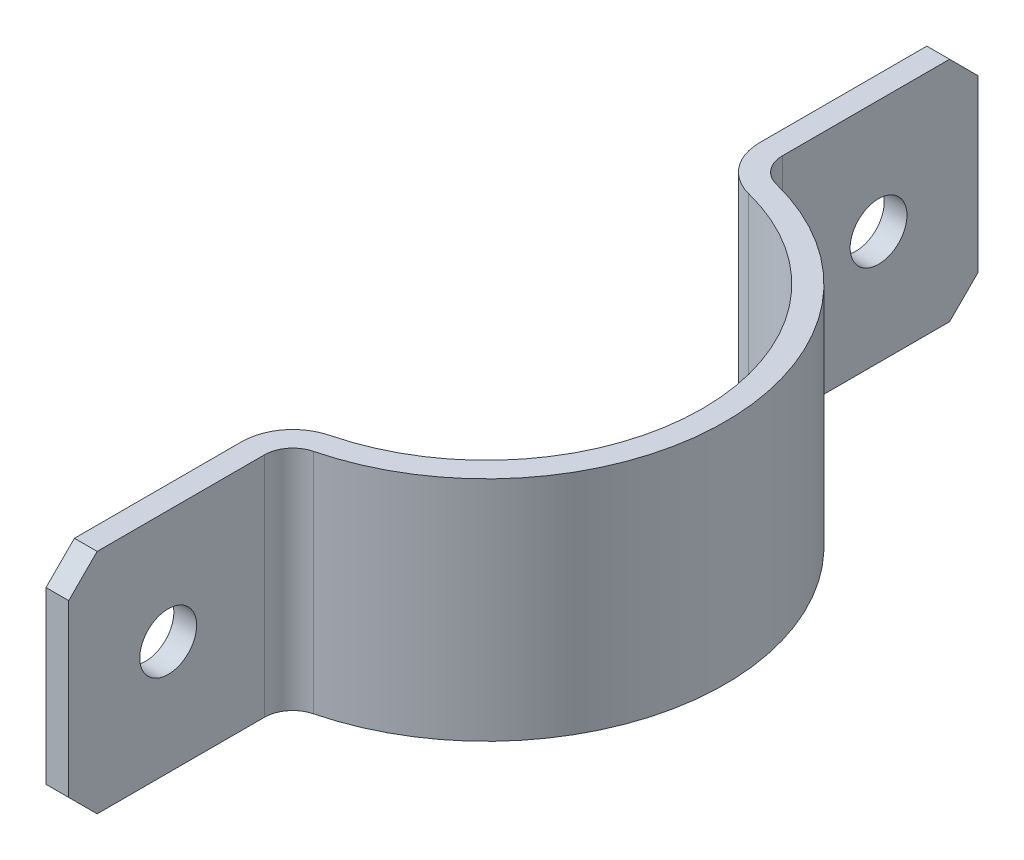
ISO-10303-21;
HEADER;
FILE_DESCRIPTION(('STEP AP214'),'2;1');
FILE_NAME('part.step','',(''),(''),'','','');
FILE_SCHEMA(('AUTOMOTIVE_DESIGN { 1 0 10303 214 1 1 1 1 }'));
ENDSEC;
DATA;
#1=APPLICATION_CONTEXT('core data for automotive mechanical design processes');
#2=APPLICATION_PROTOCOL_DEFINITION('international standard','automotive_design',2000,#1);
#3=PRODUCT_CONTEXT('',#1,'mechanical');
#4=PRODUCT('Part','Part','',(#3));
#5=PRODUCT_RELATED_PRODUCT_CATEGORY('part','',(#4));
#6=PRODUCT_DEFINITION_FORMATION('','',#4);
#7=PRODUCT_DEFINITION_CONTEXT('part definition',#1,'design');
#8=PRODUCT_DEFINITION('design','',#6,#7);
#9=PRODUCT_DEFINITION_SHAPE('','',#8);
#10=(LENGTH_UNIT() NAMED_UNIT(*) SI_UNIT(.MILLI.,.METRE.));
#11=(NAMED_UNIT(*) PLANE_ANGLE_UNIT() SI_UNIT($,.RADIAN.));
#12=(NAMED_UNIT(*) SI_UNIT($,.STERADIAN.) SOLID_ANGLE_UNIT());
#13=UNCERTAINTY_MEASURE_WITH_UNIT(LENGTH_MEASURE(1.E-05),#10,'distance_accuracy_value','');
#14=(GEOMETRIC_REPRESENTATION_CONTEXT(3) GLOBAL_UNCERTAINTY_ASSIGNED_CONTEXT((#13)) GLOBAL_UNIT_ASSIGNED_CONTEXT((#10,
#11,#12)) REPRESENTATION_CONTEXT('',''));
#15=CARTESIAN_POINT('',(0.,0.,0.));
#16=DIRECTION('',(0.,0.,1.));
#17=DIRECTION('',(1.,0.,0.));
#18=AXIS2_PLACEMENT_3D('',#15,#16,#17);
#19=CARTESIAN_POINT('',(4.1275,-9.525,-50.8000000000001));
#20=DIRECTION('',(0.,0.,-1.));
#21=DIRECTION('',(-1.,0.,0.));
#22=AXIS2_PLACEMENT_3D('',#19,#20,#21);
#23=PLANE('',#22);
#24=DIRECTION('',(0.,1.,0.));
#25=VECTOR('',#24,1.);
#26=CARTESIAN_POINT('',(4.1275,0.,-50.8000000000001));
#27=LINE('',#26,#25);
#28=CARTESIAN_POINT('',(4.1275,-9.525,-50.8000000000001));
#29=VERTEX_POINT('',#28);
#30=CARTESIAN_POINT('',(4.1275,9.525,-50.8000000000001));
#31=VERTEX_POINT('',#30);
#32=EDGE_CURVE('E105',#29,#31,#27,.T.);
#33=ORIENTED_EDGE('',*,*,#32,.F.);
#34=DIRECTION('',(1.,0.,0.));
#35=VECTOR('',#34,1.);
#36=CARTESIAN_POINT('',(2.8575,-9.525,-50.8000000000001));
#37=LINE('',#36,#35);
#38=CARTESIAN_POINT('',(1.5875,-9.525,-50.8000000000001));
#39=VERTEX_POINT('',#38);
#40=EDGE_CURVE('E221',#39,#29,#37,.T.);
#41=ORIENTED_EDGE('',*,*,#40,.F.);
#42=DIRECTION('',(0.,1.,0.));
#43=VECTOR('',#42,1.);
#44=CARTESIAN_POINT('',(1.5875,0.,-50.8000000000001));
#45=LINE('',#44,#43);
#46=CARTESIAN_POINT('',(1.5875,9.525,-50.8000000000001));
#47=VERTEX_POINT('',#46);
#48=EDGE_CURVE('E214',#39,#47,#45,.T.);
#49=ORIENTED_EDGE('',*,*,#48,.T.);
#50=DIRECTION('',(1.,0.,0.));
#51=VECTOR('',#50,1.);
#52=CARTESIAN_POINT('',(2.8575,9.525,-50.8000000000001));
#53=LINE('',#52,#51);
#54=EDGE_CURVE('E228',#47,#31,#53,.T.);
#55=ORIENTED_EDGE('',*,*,#54,.T.);
#56=EDGE_LOOP('',(#33,#41,#49,#55));
#57=FACE_BOUND('',#56,.T.);
#58=ADVANCED_FACE('F15',(#57),#23,.T.);
#59=CARTESIAN_POINT('',(1.5875,0.,-39.6875));
#60=DIRECTION('',(1.,0.,0.));
#61=DIRECTION('',(0.,0.,-1.));
#62=AXIS2_PLACEMENT_3D('',#59,#60,#61);
#63=CYLINDRICAL_SURFACE('',#62,3.175);
#64=CARTESIAN_POINT('',(4.1275,0.,-39.6875));
#65=DIRECTION('',(1.,0.,0.));
#66=DIRECTION('',(0.,0.,-1.));
#67=AXIS2_PLACEMENT_3D('',#64,#65,#66);
#68=CIRCLE('',#67,3.175);
#69=CARTESIAN_POINT('',(4.1275,0.,-42.8625));
#70=VERTEX_POINT('',#69);
#71=EDGE_CURVE('E215',#70,#70,#68,.F.);
#72=ORIENTED_EDGE('',*,*,#71,.F.);
#73=EDGE_LOOP('',(#72));
#74=FACE_BOUND('',#73,.T.);
#75=CARTESIAN_POINT('',(1.5875,0.,-39.6875));
#76=DIRECTION('',(1.,0.,0.));
#77=DIRECTION('',(0.,0.,-1.));
#78=AXIS2_PLACEMENT_3D('',#75,#76,#77);
#79=CIRCLE('',#78,3.175);
#80=CARTESIAN_POINT('',(1.5875,0.,-42.8625));
#81=VERTEX_POINT('',#80);
#82=EDGE_CURVE('E205',#81,#81,#79,.F.);
#83=ORIENTED_EDGE('',*,*,#82,.T.);
#84=EDGE_LOOP('',(#83));
#85=FACE_BOUND('',#84,.T.);
#86=ADVANCED_FACE('F348',(#74,#85),#63,.F.);
#87=CARTESIAN_POINT('',(1.5875,12.7,-47.6250000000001));
#88=DIRECTION('',(0.,-0.707106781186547,0.707106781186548));
#89=DIRECTION('',(0.,-0.707106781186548,-0.707106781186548));
#90=AXIS2_PLACEMENT_3D('',#87,#88,#89);
#91=PLANE('',#90);
#92=DIRECTION('',(0.,0.707106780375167,0.707106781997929));
#93=VECTOR('',#92,1.);
#94=CARTESIAN_POINT('',(4.1275,9.525,-50.8000000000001));
#95=LINE('',#94,#93);
#96=CARTESIAN_POINT('',(4.12750000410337,12.6999999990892,-47.6249999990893));
#97=VERTEX_POINT('',#96);
#98=EDGE_CURVE('E19',#31,#97,#95,.T.);
#99=ORIENTED_EDGE('',*,*,#98,.F.);
#100=ORIENTED_EDGE('',*,*,#54,.F.);
#101=DIRECTION('',(0.,-0.707106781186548,-0.707106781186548));
#102=VECTOR('',#101,1.);
#103=CARTESIAN_POINT('',(1.5875,12.7,-47.6250000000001));
#104=LINE('',#103,#102);
#105=CARTESIAN_POINT('',(1.5875,12.7,-47.6250000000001));
#106=VERTEX_POINT('',#105);
#107=EDGE_CURVE('E212',#47,#106,#104,.F.);
#108=ORIENTED_EDGE('',*,*,#107,.T.);
#109=DIRECTION('',(-1.,0.,0.));
#110=VECTOR('',#109,1.);
#111=CARTESIAN_POINT('',(14.2039975,12.7,-47.6250000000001));
#112=LINE('',#111,#110);
#113=EDGE_CURVE('E267',#97,#106,#112,.T.);
#114=ORIENTED_EDGE('',*,*,#113,.F.);
#115=EDGE_LOOP('',(#99,#100,#108,#114));
#116=FACE_BOUND('',#115,.T.);
#117=ADVANCED_FACE('F280',(#116),#91,.F.);
#118=CARTESIAN_POINT('',(7.30250000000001,12.7,-28.937821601));
#119=DIRECTION('',(0.,-1.,0.));
#120=DIRECTION('',(0.,0.,-1.));
#121=AXIS2_PLACEMENT_3D('',#118,#119,#120);
#122=CYLINDRICAL_SURFACE('',#121,3.175);
#123=CARTESIAN_POINT('',(7.30250000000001,12.7,-28.937821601));
#124=DIRECTION('',(0.,-1.,0.));
#125=DIRECTION('',(0.,0.,-1.));
#126=AXIS2_PLACEMENT_3D('',#123,#124,#125);
#127=CIRCLE('',#126,3.175);
#128=CARTESIAN_POINT('',(6.52563829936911,12.7,-25.8593299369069));
#129=VERTEX_POINT('',#128);
#130=CARTESIAN_POINT('',(4.12750000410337,12.7,-28.937821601));
#131=VERTEX_POINT('',#130);
#132=EDGE_CURVE('E194',#129,#131,#127,.T.);
#133=ORIENTED_EDGE('',*,*,#132,.F.);
#134=DIRECTION('',(0.,1.,0.));
#135=VECTOR('',#134,1.);
#136=CARTESIAN_POINT('',(6.52563830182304,0.,-25.8593299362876));
#137=LINE('',#136,#135);
#138=CARTESIAN_POINT('',(6.52563829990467,-12.7,-25.8593299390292));
#139=VERTEX_POINT('',#138);
#140=EDGE_CURVE('E251',#129,#139,#137,.F.);
#141=ORIENTED_EDGE('',*,*,#140,.T.);
#142=CARTESIAN_POINT('',(7.30250000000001,-12.7,-28.937821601));
#143=DIRECTION('',(0.,-1.,0.));
#144=DIRECTION('',(0.,0.,-1.));
#145=AXIS2_PLACEMENT_3D('',#142,#143,#144);
#146=CIRCLE('',#145,3.175);
#147=CARTESIAN_POINT('',(4.12750000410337,-12.7,-28.937821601));
#148=VERTEX_POINT('',#147);
#149=EDGE_CURVE('E186',#139,#148,#146,.T.);
#150=ORIENTED_EDGE('',*,*,#149,.T.);
#151=DIRECTION('',(0.,-1.,0.));
#152=VECTOR('',#151,1.);
#153=CARTESIAN_POINT('',(4.1275,0.,-28.937821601));
#154=LINE('',#153,#152);
#155=EDGE_CURVE('E226',#131,#148,#154,.T.);
#156=ORIENTED_EDGE('',*,*,#155,.F.);
#157=EDGE_LOOP('',(#133,#141,#150,#156));
#158=FACE_BOUND('',#157,.T.);
#159=ADVANCED_FACE('F345',(#158),#122,.F.);
#160=CARTESIAN_POINT('',(4.1275,-12.7,-28.937821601));
#161=DIRECTION('',(1.,0.,0.));
#162=DIRECTION('',(0.,0.,-1.));
#163=AXIS2_PLACEMENT_3D('',#160,#161,#162);
#164=PLANE('',#163);
#165=ORIENTED_EDGE('',*,*,#71,.T.);
#166=EDGE_LOOP('',(#165));
#167=FACE_BOUND('',#166,.T.);
#168=ORIENTED_EDGE('',*,*,#32,.T.);
#169=ORIENTED_EDGE('',*,*,#98,.T.);
#170=DIRECTION('',(0.,0.,-1.));
#171=VECTOR('',#170,1.);
#172=CARTESIAN_POINT('',(4.12750000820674,12.7,0.));
#173=LINE('',#172,#171);
#174=EDGE_CURVE('E196',#131,#97,#173,.T.);
#175=ORIENTED_EDGE('',*,*,#174,.F.);
#176=ORIENTED_EDGE('',*,*,#155,.T.);
#177=DIRECTION('',(0.,0.,-1.));
#178=VECTOR('',#177,1.);
#179=CARTESIAN_POINT('',(4.12750000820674,-12.7,0.));
#180=LINE('',#179,#178);
#181=CARTESIAN_POINT('',(4.12750000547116,-12.7,-47.6250000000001));
#182=VERTEX_POINT('',#181);
#183=EDGE_CURVE('E189',#148,#182,#180,.T.);
#184=ORIENTED_EDGE('',*,*,#183,.T.);
#185=DIRECTION('',(0.,-0.707106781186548,0.707106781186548));
#186=VECTOR('',#185,1.);
#187=CARTESIAN_POINT('',(4.1275,-11.1125,-49.2125000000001));
#188=LINE('',#187,#186);
#189=EDGE_CURVE('E217',#29,#182,#188,.T.);
#190=ORIENTED_EDGE('',*,*,#189,.F.);
#191=EDGE_LOOP('',(#168,#169,#175,#176,#184,#190));
#192=FACE_BOUND('',#191,.T.);
#193=ADVANCED_FACE('F341',(#167,#192),#164,.T.);
#194=CARTESIAN_POINT('',(1.5875,-12.7,-47.6250000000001));
#195=DIRECTION('',(0.,-0.707106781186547,-0.707106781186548));
#196=DIRECTION('',(0.,0.707106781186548,-0.707106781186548));
#197=AXIS2_PLACEMENT_3D('',#194,#195,#196);
#198=PLANE('',#197);
#199=DIRECTION('',(0.,0.707106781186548,-0.707106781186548));
#200=VECTOR('',#199,1.);
#201=CARTESIAN_POINT('',(1.5875,-12.7,-47.6250000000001));
#202=LINE('',#201,#200);
#203=CARTESIAN_POINT('',(1.5875,-12.7,-47.6250000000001));
#204=VERTEX_POINT('',#203);
#205=EDGE_CURVE('E209',#204,#39,#202,.T.);
#206=ORIENTED_EDGE('',*,*,#205,.T.);
#207=ORIENTED_EDGE('',*,*,#40,.T.);
#208=ORIENTED_EDGE('',*,*,#189,.T.);
#209=DIRECTION('',(-1.,0.,0.));
#210=VECTOR('',#209,1.);
#211=CARTESIAN_POINT('',(14.2039975,-12.7,-47.6250000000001));
#212=LINE('',#211,#210);
#213=EDGE_CURVE('E260',#182,#204,#212,.T.);
#214=ORIENTED_EDGE('',*,*,#213,.T.);
#215=EDGE_LOOP('',(#206,#207,#208,#214));
#216=FACE_BOUND('',#215,.T.);
#217=ADVANCED_FACE('F337',(#216),#198,.T.);
#218=CARTESIAN_POINT('',(1.5875,-12.7,-28.937821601));
#219=DIRECTION('',(1.,0.,0.));
#220=DIRECTION('',(0.,0.,-1.));
#221=AXIS2_PLACEMENT_3D('',#218,#219,#220);
#222=PLANE('',#221);
#223=ORIENTED_EDGE('',*,*,#82,.F.);
#224=EDGE_LOOP('',(#223));
#225=FACE_BOUND('',#224,.T.);
#226=DIRECTION('',(0.,0.,1.));
#227=VECTOR('',#226,1.);
#228=CARTESIAN_POINT('',(1.5875,-12.7,0.));
#229=LINE('',#228,#227);
#230=CARTESIAN_POINT('',(1.5875,-12.7,-28.9378215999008));
#231=VERTEX_POINT('',#230);
#232=EDGE_CURVE('E185',#204,#231,#229,.T.);
#233=ORIENTED_EDGE('',*,*,#232,.T.);
#234=DIRECTION('',(0.,-1.,0.));
#235=VECTOR('',#234,1.);
#236=CARTESIAN_POINT('',(1.5875,0.,-28.9378215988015));
#237=LINE('',#236,#235);
#238=CARTESIAN_POINT('',(1.5875,12.7,-28.9378215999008));
#239=VERTEX_POINT('',#238);
#240=EDGE_CURVE('E208',#231,#239,#237,.F.);
#241=ORIENTED_EDGE('',*,*,#240,.T.);
#242=DIRECTION('',(0.,0.,1.));
#243=VECTOR('',#242,1.);
#244=CARTESIAN_POINT('',(1.5875,12.7,0.));
#245=LINE('',#244,#243);
#246=EDGE_CURVE('E193',#106,#239,#245,.T.);
#247=ORIENTED_EDGE('',*,*,#246,.F.);
#248=ORIENTED_EDGE('',*,*,#107,.F.);
#249=ORIENTED_EDGE('',*,*,#48,.F.);
#250=ORIENTED_EDGE('',*,*,#205,.F.);
#251=EDGE_LOOP('',(#233,#241,#247,#248,#249,#250));
#252=FACE_BOUND('',#251,.T.);
#253=ADVANCED_FACE('F275',(#225,#252),#222,.F.);
#254=CARTESIAN_POINT('',(7.30250000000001,12.7,-28.937821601));
#255=DIRECTION('',(0.,-1.,0.));
#256=DIRECTION('',(0.,0.,-1.));
#257=AXIS2_PLACEMENT_3D('',#254,#255,#256);
#258=CYLINDRICAL_SURFACE('',#257,5.715);
#259=CARTESIAN_POINT('',(7.30250000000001,-12.7,-28.937821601));
#260=DIRECTION('',(0.,-1.,0.));
#261=DIRECTION('',(0.,0.,-1.));
#262=AXIS2_PLACEMENT_3D('',#259,#260,#261);
#263=CIRCLE('',#262,5.715);
#264=CARTESIAN_POINT('',(5.90414893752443,-12.7,-23.3965366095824));
#265=VERTEX_POINT('',#264);
#266=EDGE_CURVE('E182',#231,#265,#263,.F.);
#267=ORIENTED_EDGE('',*,*,#266,.T.);
#268=DIRECTION('',(0.,1.,0.));
#269=VECTOR('',#268,1.);
#270=CARTESIAN_POINT('',(5.90414893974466,0.,-23.3965366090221));
#271=LINE('',#270,#269);
#272=CARTESIAN_POINT('',(5.90414893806,12.7,-23.3965366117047));
#273=VERTEX_POINT('',#272);
#274=EDGE_CURVE('E254',#273,#265,#271,.F.);
#275=ORIENTED_EDGE('',*,*,#274,.F.);
#276=CARTESIAN_POINT('',(7.30250000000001,12.7,-28.937821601));
#277=DIRECTION('',(0.,-1.,0.));
#278=DIRECTION('',(0.,0.,-1.));
#279=AXIS2_PLACEMENT_3D('',#276,#277,#278);
#280=CIRCLE('',#279,5.715);
#281=EDGE_CURVE('E190',#239,#273,#280,.F.);
#282=ORIENTED_EDGE('',*,*,#281,.F.);
#283=ORIENTED_EDGE('',*,*,#240,.F.);
#284=EDGE_LOOP('',(#267,#275,#282,#283));
#285=FACE_BOUND('',#284,.T.);
#286=ADVANCED_FACE('F336',(#285),#258,.T.);
#287=CARTESIAN_POINT('',(0.,12.7,0.));
#288=DIRECTION('',(0.,-1.,0.));
#289=DIRECTION('',(0.,0.,-1.));
#290=AXIS2_PLACEMENT_3D('',#287,#288,#289);
#291=CYLINDRICAL_SURFACE('',#290,24.13);
#292=CARTESIAN_POINT('',(0.,12.7,0.));
#293=DIRECTION('',(0.,-1.,0.));
#294=DIRECTION('',(0.,0.,-1.));
#295=AXIS2_PLACEMENT_3D('',#292,#293,#294);
#296=CIRCLE('',#295,24.13);
#297=CARTESIAN_POINT('',(5.9041489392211,12.7,23.3965366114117));
#298=VERTEX_POINT('',#297);
#299=EDGE_CURVE('E202',#273,#298,#296,.T.);
#300=ORIENTED_EDGE('',*,*,#299,.F.);
#301=ORIENTED_EDGE('',*,*,#274,.T.);
#302=CARTESIAN_POINT('',(0.,-12.7,0.));
#303=DIRECTION('',(0.,-1.,0.));
#304=DIRECTION('',(0.,0.,-1.));
#305=AXIS2_PLACEMENT_3D('',#302,#303,#304);
#306=CIRCLE('',#305,24.13);
#307=CARTESIAN_POINT('',(5.90414893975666,-12.7,23.396536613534));
#308=VERTEX_POINT('',#307);
#309=EDGE_CURVE('E179',#265,#308,#306,.T.);
#310=ORIENTED_EDGE('',*,*,#309,.T.);
#311=DIRECTION('',(0.,-1.,0.));
#312=VECTOR('',#311,1.);
#313=CARTESIAN_POINT('',(5.904148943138,0.,23.3965366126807));
#314=LINE('',#313,#312);
#315=EDGE_CURVE('E204',#308,#298,#314,.F.);
#316=ORIENTED_EDGE('',*,*,#315,.T.);
#317=EDGE_LOOP('',(#300,#301,#310,#316));
#318=FACE_BOUND('',#317,.T.);
#319=ADVANCED_FACE('F357',(#318),#291,.F.);
#320=CARTESIAN_POINT('',(0.,12.7,0.));
#321=DIRECTION('',(0.,-1.,0.));
#322=DIRECTION('',(0.,0.,-1.));
#323=AXIS2_PLACEMENT_3D('',#320,#321,#322);
#324=CYLINDRICAL_SURFACE('',#323,26.67);
#325=DIRECTION('',(0.,-1.,0.));
#326=VECTOR('',#325,1.);
#327=CARTESIAN_POINT('',(6.52563829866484,0.,25.8593299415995));
#328=LINE('',#327,#326);
#329=CARTESIAN_POINT('',(6.52563829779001,-12.7,25.8593299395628));
#330=VERTEX_POINT('',#329);
#331=CARTESIAN_POINT('',(6.52563829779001,12.7,25.8593299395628));
#332=VERTEX_POINT('',#331);
#333=EDGE_CURVE('E169',#330,#332,#328,.F.);
#334=ORIENTED_EDGE('',*,*,#333,.F.);
#335=CARTESIAN_POINT('',(0.,-12.7,0.));
#336=DIRECTION('',(0.,-1.,0.));
#337=DIRECTION('',(0.,0.,-1.));
#338=AXIS2_PLACEMENT_3D('',#335,#336,#337);
#339=CIRCLE('',#338,26.67);
#340=EDGE_CURVE('E173',#330,#139,#339,.F.);
#341=ORIENTED_EDGE('',*,*,#340,.T.);
#342=ORIENTED_EDGE('',*,*,#140,.F.);
#343=CARTESIAN_POINT('',(0.,12.7,0.));
#344=DIRECTION('',(0.,-1.,0.));
#345=DIRECTION('',(0.,0.,-1.));
#346=AXIS2_PLACEMENT_3D('',#343,#344,#345);
#347=CIRCLE('',#346,26.67);
#348=EDGE_CURVE('E197',#332,#129,#347,.F.);
#349=ORIENTED_EDGE('',*,*,#348,.F.);
#350=EDGE_LOOP('',(#334,#341,#342,#349));
#351=FACE_BOUND('',#350,.T.);
#352=ADVANCED_FACE('F353',(#351),#324,.T.);
#353=CARTESIAN_POINT('',(7.30250000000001,12.7,28.937821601));
#354=DIRECTION('',(0.,-1.,0.));
#355=DIRECTION('',(0.,0.,-1.));
#356=AXIS2_PLACEMENT_3D('',#353,#354,#355);
#357=CYLINDRICAL_SURFACE('',#356,5.715);
#358=CARTESIAN_POINT('',(7.30250000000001,12.7,28.937821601));
#359=DIRECTION('',(0.,-1.,0.));
#360=DIRECTION('',(0.,0.,-1.));
#361=AXIS2_PLACEMENT_3D('',#358,#359,#360);
#362=CIRCLE('',#361,5.715);
#363=CARTESIAN_POINT('',(1.5875,12.7,28.937821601));
#364=VERTEX_POINT('',#363);
#365=EDGE_CURVE('E200',#298,#364,#362,.F.);
#366=ORIENTED_EDGE('',*,*,#365,.F.);
#367=ORIENTED_EDGE('',*,*,#315,.F.);
#368=CARTESIAN_POINT('',(7.30250000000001,-12.7,28.937821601));
#369=DIRECTION('',(0.,-1.,0.));
#370=DIRECTION('',(0.,0.,-1.));
#371=AXIS2_PLACEMENT_3D('',#368,#369,#370);
#372=CIRCLE('',#371,5.715);
#373=CARTESIAN_POINT('',(1.5875,-12.7,28.937821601));
#374=VERTEX_POINT('',#373);
#375=EDGE_CURVE('E177',#308,#374,#372,.F.);
#376=ORIENTED_EDGE('',*,*,#375,.T.);
#377=DIRECTION('',(0.,1.,0.));
#378=VECTOR('',#377,1.);
#379=CARTESIAN_POINT('',(1.5875,0.,28.937821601));
#380=LINE('',#379,#378);
#381=EDGE_CURVE('E160',#374,#364,#380,.T.);
#382=ORIENTED_EDGE('',*,*,#381,.T.);
#383=EDGE_LOOP('',(#366,#367,#376,#382));
#384=FACE_BOUND('',#383,.T.);
#385=ADVANCED_FACE('F333',(#384),#357,.T.);
#386=CARTESIAN_POINT('',(1.5875,12.7,-47.6250000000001));
#387=DIRECTION('',(0.,1.,0.));
#388=DIRECTION('',(0.,0.,1.));
#389=AXIS2_PLACEMENT_3D('',#386,#387,#388);
#390=PLANE('',#389);
#391=ORIENTED_EDGE('',*,*,#246,.T.);
#392=ORIENTED_EDGE('',*,*,#281,.T.);
#393=ORIENTED_EDGE('',*,*,#299,.T.);
#394=ORIENTED_EDGE('',*,*,#365,.T.);
#395=DIRECTION('',(0.,0.,1.));
#396=VECTOR('',#395,1.);
#397=CARTESIAN_POINT('',(1.5875,12.7,39.8689108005));
#398=LINE('',#397,#396);
#399=CARTESIAN_POINT('',(1.5875,12.7,47.6250000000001));
#400=VERTEX_POINT('',#399);
#401=EDGE_CURVE('E158',#364,#400,#398,.T.);
#402=ORIENTED_EDGE('',*,*,#401,.T.);
#403=DIRECTION('',(1.,0.,0.));
#404=VECTOR('',#403,1.);
#405=CARTESIAN_POINT('',(2.8575,12.7,47.6250000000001));
#406=LINE('',#405,#404);
#407=CARTESIAN_POINT('',(4.1275,12.7,47.6249999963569));
#408=VERTEX_POINT('',#407);
#409=EDGE_CURVE('E143',#400,#408,#406,.T.);
#410=ORIENTED_EDGE('',*,*,#409,.T.);
#411=DIRECTION('',(0.,0.,1.));
#412=VECTOR('',#411,1.);
#413=CARTESIAN_POINT('',(4.1275,12.7,39.8689108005));
#414=LINE('',#413,#412);
#415=CARTESIAN_POINT('',(4.1275,12.7,28.937821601));
#416=VERTEX_POINT('',#415);
#417=EDGE_CURVE('E240',#416,#408,#414,.T.);
#418=ORIENTED_EDGE('',*,*,#417,.F.);
#419=CARTESIAN_POINT('',(7.30250000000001,12.7,28.937821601));
#420=DIRECTION('',(0.,-1.,0.));
#421=DIRECTION('',(0.,0.,-1.));
#422=AXIS2_PLACEMENT_3D('',#419,#420,#421);
#423=CIRCLE('',#422,3.175);
#424=EDGE_CURVE('E165',#332,#416,#423,.F.);
#425=ORIENTED_EDGE('',*,*,#424,.F.);
#426=ORIENTED_EDGE('',*,*,#348,.T.);
#427=ORIENTED_EDGE('',*,*,#132,.T.);
#428=ORIENTED_EDGE('',*,*,#174,.T.);
#429=ORIENTED_EDGE('',*,*,#113,.T.);
#430=EDGE_LOOP('',(#391,#392,#393,#394,#402,#410,#418,#425,#426,#427,#428,#429));
#431=FACE_BOUND('',#430,.T.);
#432=ADVANCED_FACE('F282',(#431),#390,.T.);
#433=CARTESIAN_POINT('',(4.1275,12.7,47.6250000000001));
#434=DIRECTION('',(0.,-0.707106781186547,-0.707106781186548));
#435=DIRECTION('',(0.,-0.707106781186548,0.707106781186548));
#436=AXIS2_PLACEMENT_3D('',#433,#434,#435);
#437=PLANE('',#436);
#438=DIRECTION('',(0.,-0.707106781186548,0.707106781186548));
#439=VECTOR('',#438,1.);
#440=CARTESIAN_POINT('',(1.5875,12.7,47.6250000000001));
#441=LINE('',#440,#439);
#442=CARTESIAN_POINT('',(1.5875,9.525,50.8000000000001));
#443=VERTEX_POINT('',#442);
#444=EDGE_CURVE('E150',#400,#443,#441,.T.);
#445=ORIENTED_EDGE('',*,*,#444,.T.);
#446=DIRECTION('',(-1.,0.,0.));
#447=VECTOR('',#446,1.);
#448=CARTESIAN_POINT('',(2.8575,9.525,50.8000000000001));
#449=LINE('',#448,#447);
#450=CARTESIAN_POINT('',(4.1275,9.525,50.8000000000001));
#451=VERTEX_POINT('',#450);
#452=EDGE_CURVE('E133',#451,#443,#449,.T.);
#453=ORIENTED_EDGE('',*,*,#452,.F.);
#454=DIRECTION('',(0.,-0.707106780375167,0.707106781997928));
#455=VECTOR('',#454,1.);
#456=CARTESIAN_POINT('',(4.1275,12.7,47.6249999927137));
#457=LINE('',#456,#455);
#458=EDGE_CURVE('E239',#408,#451,#457,.T.);
#459=ORIENTED_EDGE('',*,*,#458,.F.);
#460=ORIENTED_EDGE('',*,*,#409,.F.);
#461=EDGE_LOOP('',(#445,#453,#459,#460));
#462=FACE_BOUND('',#461,.T.);
#463=ADVANCED_FACE('F156',(#462),#437,.F.);
#464=CARTESIAN_POINT('',(4.1275,9.525,50.8000000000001));
#465=DIRECTION('',(0.,0.,1.));
#466=DIRECTION('',(-1.,0.,0.));
#467=AXIS2_PLACEMENT_3D('',#464,#465,#466);
#468=PLANE('',#467);
#469=DIRECTION('',(0.,-1.,0.));
#470=VECTOR('',#469,1.);
#471=CARTESIAN_POINT('',(4.1275,0.,50.8000000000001));
#472=LINE('',#471,#470);
#473=CARTESIAN_POINT('',(4.1275,-9.525,50.8000000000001));
#474=VERTEX_POINT('',#473);
#475=EDGE_CURVE('E138',#451,#474,#472,.T.);
#476=ORIENTED_EDGE('',*,*,#475,.F.);
#477=ORIENTED_EDGE('',*,*,#452,.T.);
#478=DIRECTION('',(0.,-1.,0.));
#479=VECTOR('',#478,1.);
#480=CARTESIAN_POINT('',(1.5875,0.,50.8000000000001));
#481=LINE('',#480,#479);
#482=CARTESIAN_POINT('',(1.5875,-9.525,50.8000000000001));
#483=VERTEX_POINT('',#482);
#484=EDGE_CURVE('E137',#443,#483,#481,.T.);
#485=ORIENTED_EDGE('',*,*,#484,.T.);
#486=DIRECTION('',(-1.,0.,0.));
#487=VECTOR('',#486,1.);
#488=CARTESIAN_POINT('',(2.8575,-9.525,50.8000000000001));
#489=LINE('',#488,#487);
#490=EDGE_CURVE('E142',#474,#483,#489,.T.);
#491=ORIENTED_EDGE('',*,*,#490,.F.);
#492=EDGE_LOOP('',(#476,#477,#485,#491));
#493=FACE_BOUND('',#492,.T.);
#494=ADVANCED_FACE('F135',(#493),#468,.T.);
#495=CARTESIAN_POINT('',(4.1275,-12.7,47.6250000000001));
#496=DIRECTION('',(0.,-0.707106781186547,0.707106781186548));
#497=DIRECTION('',(0.,0.707106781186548,0.707106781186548));
#498=AXIS2_PLACEMENT_3D('',#495,#496,#497);
#499=PLANE('',#498);
#500=DIRECTION('',(0.,0.707106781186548,0.707106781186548));
#501=VECTOR('',#500,1.);
#502=CARTESIAN_POINT('',(1.5875,-12.7,47.6250000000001));
#503=LINE('',#502,#501);
#504=CARTESIAN_POINT('',(1.5875,-12.7,47.6250000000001));
#505=VERTEX_POINT('',#504);
#506=EDGE_CURVE('E154',#483,#505,#503,.F.);
#507=ORIENTED_EDGE('',*,*,#506,.T.);
#508=DIRECTION('',(1.,0.,0.));
#509=VECTOR('',#508,1.);
#510=CARTESIAN_POINT('',(14.2039975,-12.7,47.6250000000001));
#511=LINE('',#510,#509);
#512=CARTESIAN_POINT('',(4.1275,-12.7,47.6249999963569));
#513=VERTEX_POINT('',#512);
#514=EDGE_CURVE('E176',#505,#513,#511,.T.);
#515=ORIENTED_EDGE('',*,*,#514,.T.);
#516=DIRECTION('',(0.,-0.707106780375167,-0.707106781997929));
#517=VECTOR('',#516,1.);
#518=CARTESIAN_POINT('',(4.1275,-9.525,50.8000000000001));
#519=LINE('',#518,#517);
#520=EDGE_CURVE('E238',#474,#513,#519,.T.);
#521=ORIENTED_EDGE('',*,*,#520,.F.);
#522=ORIENTED_EDGE('',*,*,#490,.T.);
#523=EDGE_LOOP('',(#507,#515,#521,#522));
#524=FACE_BOUND('',#523,.T.);
#525=ADVANCED_FACE('F299',(#524),#499,.T.);
#526=CARTESIAN_POINT('',(1.5875,-12.7,-47.6250000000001));
#527=DIRECTION('',(0.,1.,0.));
#528=DIRECTION('',(0.,0.,1.));
#529=AXIS2_PLACEMENT_3D('',#526,#527,#528);
#530=PLANE('',#529);
#531=CARTESIAN_POINT('',(7.30250000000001,-12.7,28.937821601));
#532=DIRECTION('',(0.,-1.,0.));
#533=DIRECTION('',(0.,0.,-1.));
#534=AXIS2_PLACEMENT_3D('',#531,#532,#533);
#535=CIRCLE('',#534,3.175);
#536=CARTESIAN_POINT('',(4.1275,-12.7,28.937821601));
#537=VERTEX_POINT('',#536);
#538=EDGE_CURVE('E170',#537,#330,#535,.T.);
#539=ORIENTED_EDGE('',*,*,#538,.F.);
#540=DIRECTION('',(0.,0.,-1.));
#541=VECTOR('',#540,1.);
#542=CARTESIAN_POINT('',(4.1275,-12.7,39.8689108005));
#543=LINE('',#542,#541);
#544=EDGE_CURVE('E34',#513,#537,#543,.T.);
#545=ORIENTED_EDGE('',*,*,#544,.F.);
#546=ORIENTED_EDGE('',*,*,#514,.F.);
#547=DIRECTION('',(0.,0.,-1.));
#548=VECTOR('',#547,1.);
#549=CARTESIAN_POINT('',(1.5875,-12.7,39.8689108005));
#550=LINE('',#549,#548);
#551=EDGE_CURVE('E168',#505,#374,#550,.T.);
#552=ORIENTED_EDGE('',*,*,#551,.T.);
#553=ORIENTED_EDGE('',*,*,#375,.F.);
#554=ORIENTED_EDGE('',*,*,#309,.F.);
#555=ORIENTED_EDGE('',*,*,#266,.F.);
#556=ORIENTED_EDGE('',*,*,#232,.F.);
#557=ORIENTED_EDGE('',*,*,#213,.F.);
#558=ORIENTED_EDGE('',*,*,#183,.F.);
#559=ORIENTED_EDGE('',*,*,#149,.F.);
#560=ORIENTED_EDGE('',*,*,#340,.F.);
#561=EDGE_LOOP('',(#539,#545,#546,#552,#553,#554,#555,#556,#557,#558,#559,#560));
#562=FACE_BOUND('',#561,.T.);
#563=ADVANCED_FACE('F318',(#562),#530,.F.);
#564=CARTESIAN_POINT('',(7.30250000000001,12.7,28.937821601));
#565=DIRECTION('',(0.,-1.,0.));
#566=DIRECTION('',(0.,0.,-1.));
#567=AXIS2_PLACEMENT_3D('',#564,#565,#566);
#568=CYLINDRICAL_SURFACE('',#567,3.175);
#569=ORIENTED_EDGE('',*,*,#424,.T.);
#570=DIRECTION('',(0.,1.,0.));
#571=VECTOR('',#570,1.);
#572=CARTESIAN_POINT('',(4.1275,0.,28.937821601));
#573=LINE('',#572,#571);
#574=EDGE_CURVE('E237',#537,#416,#573,.T.);
#575=ORIENTED_EDGE('',*,*,#574,.F.);
#576=ORIENTED_EDGE('',*,*,#538,.T.);
#577=ORIENTED_EDGE('',*,*,#333,.T.);
#578=EDGE_LOOP('',(#569,#575,#576,#577));
#579=FACE_BOUND('',#578,.T.);
#580=ADVANCED_FACE('F310',(#579),#568,.F.);
#581=CARTESIAN_POINT('',(1.5875,12.7,28.937821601));
#582=DIRECTION('',(1.,0.,0.));
#583=DIRECTION('',(0.,0.,1.));
#584=AXIS2_PLACEMENT_3D('',#581,#582,#583);
#585=PLANE('',#584);
#586=CARTESIAN_POINT('',(1.5875,0.,39.6875));
#587=DIRECTION('',(1.,0.,0.));
#588=DIRECTION('',(0.,0.,-1.));
#589=AXIS2_PLACEMENT_3D('',#586,#587,#588);
#590=CIRCLE('',#589,3.175);
#591=CARTESIAN_POINT('',(1.5875,0.,36.5125));
#592=VERTEX_POINT('',#591);
#593=EDGE_CURVE('E25',#592,#592,#590,.F.);
#594=ORIENTED_EDGE('',*,*,#593,.F.);
#595=EDGE_LOOP('',(#594));
#596=FACE_BOUND('',#595,.T.);
#597=ORIENTED_EDGE('',*,*,#484,.F.);
#598=ORIENTED_EDGE('',*,*,#444,.F.);
#599=ORIENTED_EDGE('',*,*,#401,.F.);
#600=ORIENTED_EDGE('',*,*,#381,.F.);
#601=ORIENTED_EDGE('',*,*,#551,.F.);
#602=ORIENTED_EDGE('',*,*,#506,.F.);
#603=EDGE_LOOP('',(#597,#598,#599,#600,#601,#602));
#604=FACE_BOUND('',#603,.T.);
#605=ADVANCED_FACE('F148',(#596,#604),#585,.F.);
#606=CARTESIAN_POINT('',(4.1275,12.7,28.937821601));
#607=DIRECTION('',(1.,0.,0.));
#608=DIRECTION('',(0.,0.,1.));
#609=AXIS2_PLACEMENT_3D('',#606,#607,#608);
#610=PLANE('',#609);
#611=CARTESIAN_POINT('',(4.1275,0.,39.6875));
#612=DIRECTION('',(1.,0.,0.));
#613=DIRECTION('',(0.,0.,-1.));
#614=AXIS2_PLACEMENT_3D('',#611,#612,#613);
#615=CIRCLE('',#614,3.175);
#616=CARTESIAN_POINT('',(4.1275,0.,36.5125));
#617=VERTEX_POINT('',#616);
#618=EDGE_CURVE('E10',#617,#617,#615,.T.);
#619=ORIENTED_EDGE('',*,*,#618,.F.);
#620=EDGE_LOOP('',(#619));
#621=FACE_BOUND('',#620,.T.);
#622=ORIENTED_EDGE('',*,*,#544,.T.);
#623=ORIENTED_EDGE('',*,*,#574,.T.);
#624=ORIENTED_EDGE('',*,*,#417,.T.);
#625=ORIENTED_EDGE('',*,*,#458,.T.);
#626=ORIENTED_EDGE('',*,*,#475,.T.);
#627=ORIENTED_EDGE('',*,*,#520,.T.);
#628=EDGE_LOOP('',(#622,#623,#624,#625,#626,#627));
#629=FACE_BOUND('',#628,.T.);
#630=ADVANCED_FACE('F17',(#621,#629),#610,.T.);
#631=CARTESIAN_POINT('',(1.5875,0.,39.6875));
#632=DIRECTION('',(1.,0.,0.));
#633=DIRECTION('',(0.,0.,-1.));
#634=AXIS2_PLACEMENT_3D('',#631,#632,#633);
#635=CYLINDRICAL_SURFACE('',#634,3.175);
#636=ORIENTED_EDGE('',*,*,#618,.T.);
#637=EDGE_LOOP('',(#636));
#638=FACE_BOUND('',#637,.T.);
#639=ORIENTED_EDGE('',*,*,#593,.T.);
#640=EDGE_LOOP('',(#639));
#641=FACE_BOUND('',#640,.T.);
#642=ADVANCED_FACE('F301',(#638,#641),#635,.F.);
#643=CLOSED_SHELL('',(#58,#86,#117,#159,#193,#217,#253,#286,#319,#352,#385,#432,#463,#494,#525,
#563,#580,#605,#630,#642));
#644=MANIFOLD_SOLID_BREP('B1',#643);
#645=ADVANCED_BREP_SHAPE_REPRESENTATION('',(#18,#644),#14);
#646=SHAPE_DEFINITION_REPRESENTATION(#9,#645);
ENDSEC;
END-ISO-10303-21;
